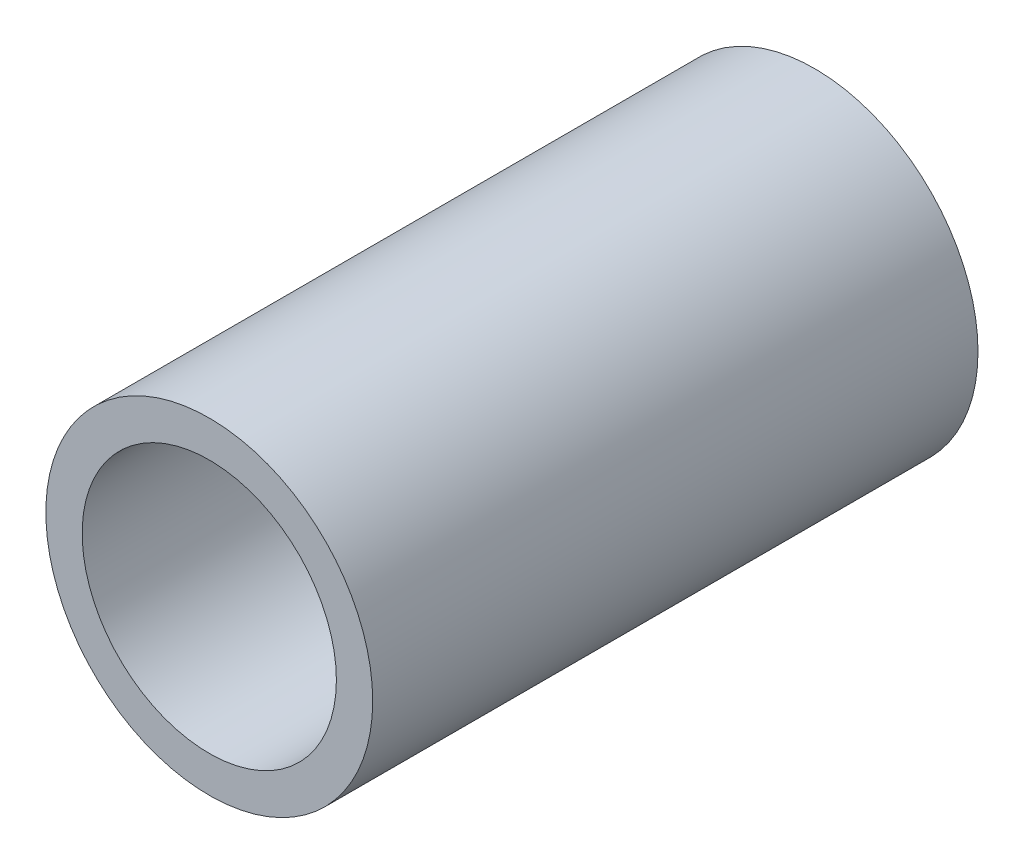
ISO-10303-21;
HEADER;
FILE_DESCRIPTION(('STEP AP214'),'2;1');
FILE_NAME('part.step','',(''),(''),'','','');
FILE_SCHEMA(('AUTOMOTIVE_DESIGN { 1 0 10303 214 1 1 1 1 }'));
ENDSEC;
DATA;
#1=APPLICATION_CONTEXT('core data for automotive mechanical design processes');
#2=APPLICATION_PROTOCOL_DEFINITION('international standard','automotive_design',2000,#1);
#3=PRODUCT_CONTEXT('',#1,'mechanical');
#4=PRODUCT('Part','Part','',(#3));
#5=PRODUCT_RELATED_PRODUCT_CATEGORY('part','',(#4));
#6=PRODUCT_DEFINITION_FORMATION('','',#4);
#7=PRODUCT_DEFINITION_CONTEXT('part definition',#1,'design');
#8=PRODUCT_DEFINITION('design','',#6,#7);
#9=PRODUCT_DEFINITION_SHAPE('','',#8);
#10=(LENGTH_UNIT() NAMED_UNIT(*) SI_UNIT(.MILLI.,.METRE.));
#11=(NAMED_UNIT(*) PLANE_ANGLE_UNIT() SI_UNIT($,.RADIAN.));
#12=(NAMED_UNIT(*) SI_UNIT($,.STERADIAN.) SOLID_ANGLE_UNIT());
#13=UNCERTAINTY_MEASURE_WITH_UNIT(LENGTH_MEASURE(1.E-05),#10,'distance_accuracy_value','');
#14=(GEOMETRIC_REPRESENTATION_CONTEXT(3) GLOBAL_UNCERTAINTY_ASSIGNED_CONTEXT((#13)) GLOBAL_UNIT_ASSIGNED_CONTEXT((#10,
#11,#12)) REPRESENTATION_CONTEXT('',''));
#15=CARTESIAN_POINT('',(0.,0.,0.));
#16=DIRECTION('',(0.,0.,1.));
#17=DIRECTION('',(1.,0.,0.));
#18=AXIS2_PLACEMENT_3D('',#15,#16,#17);
#19=CARTESIAN_POINT('',(0.,0.,50.));
#20=DIRECTION('',(0.,0.,1.));
#21=DIRECTION('',(1.,0.,0.));
#22=AXIS2_PLACEMENT_3D('',#19,#20,#21);
#23=PLANE('',#22);
#24=CARTESIAN_POINT('',(0.,0.,50.));
#25=DIRECTION('',(0.,0.,1.));
#26=DIRECTION('',(1.,0.,0.));
#27=AXIS2_PLACEMENT_3D('',#24,#25,#26);
#28=CIRCLE('',#27,13.5);
#29=CARTESIAN_POINT('',(13.5,0.,50.));
#30=VERTEX_POINT('',#29);
#31=EDGE_CURVE('E11',#30,#30,#28,.T.);
#32=ORIENTED_EDGE('',*,*,#31,.T.);
#33=EDGE_LOOP('',(#32));
#34=FACE_BOUND('',#33,.T.);
#35=CARTESIAN_POINT('',(0.,0.,50.));
#36=DIRECTION('',(0.,0.,1.));
#37=DIRECTION('',(1.,0.,0.));
#38=AXIS2_PLACEMENT_3D('',#35,#36,#37);
#39=CIRCLE('',#38,10.5);
#40=CARTESIAN_POINT('',(10.5,0.,50.));
#41=VERTEX_POINT('',#40);
#42=EDGE_CURVE('E47',#41,#41,#39,.T.);
#43=ORIENTED_EDGE('',*,*,#42,.F.);
#44=EDGE_LOOP('',(#43));
#45=FACE_BOUND('',#44,.T.);
#46=ADVANCED_FACE('F36',(#34,#45),#23,.T.);
#47=CARTESIAN_POINT('',(0.,0.,0.));
#48=DIRECTION('',(0.,0.,1.));
#49=DIRECTION('',(1.,0.,0.));
#50=AXIS2_PLACEMENT_3D('',#47,#48,#49);
#51=PLANE('',#50);
#52=CARTESIAN_POINT('',(0.,0.,0.));
#53=DIRECTION('',(0.,0.,1.));
#54=DIRECTION('',(1.,0.,0.));
#55=AXIS2_PLACEMENT_3D('',#52,#53,#54);
#56=CIRCLE('',#55,13.5);
#57=CARTESIAN_POINT('',(13.5,0.,0.));
#58=VERTEX_POINT('',#57);
#59=EDGE_CURVE('E40',#58,#58,#56,.T.);
#60=ORIENTED_EDGE('',*,*,#59,.F.);
#61=EDGE_LOOP('',(#60));
#62=FACE_BOUND('',#61,.T.);
#63=CARTESIAN_POINT('',(0.,0.,0.));
#64=DIRECTION('',(0.,0.,1.));
#65=DIRECTION('',(1.,0.,0.));
#66=AXIS2_PLACEMENT_3D('',#63,#64,#65);
#67=CIRCLE('',#66,10.5);
#68=CARTESIAN_POINT('',(10.5,0.,0.));
#69=VERTEX_POINT('',#68);
#70=EDGE_CURVE('E49',#69,#69,#67,.T.);
#71=ORIENTED_EDGE('',*,*,#70,.T.);
#72=EDGE_LOOP('',(#71));
#73=FACE_BOUND('',#72,.T.);
#74=ADVANCED_FACE('F59',(#62,#73),#51,.F.);
#75=CARTESIAN_POINT('',(0.,0.,50.));
#76=DIRECTION('',(0.,0.,-1.));
#77=DIRECTION('',(-1.,0.,0.));
#78=AXIS2_PLACEMENT_3D('',#75,#76,#77);
#79=CYLINDRICAL_SURFACE('',#78,13.5);
#80=ORIENTED_EDGE('',*,*,#31,.F.);
#81=EDGE_LOOP('',(#80));
#82=FACE_BOUND('',#81,.T.);
#83=ORIENTED_EDGE('',*,*,#59,.T.);
#84=EDGE_LOOP('',(#83));
#85=FACE_BOUND('',#84,.T.);
#86=ADVANCED_FACE('F38',(#82,#85),#79,.T.);
#87=CARTESIAN_POINT('',(0.,0.,50.));
#88=DIRECTION('',(0.,0.,-1.));
#89=DIRECTION('',(-1.,0.,0.));
#90=AXIS2_PLACEMENT_3D('',#87,#88,#89);
#91=CYLINDRICAL_SURFACE('',#90,10.5);
#92=ORIENTED_EDGE('',*,*,#42,.T.);
#93=EDGE_LOOP('',(#92));
#94=FACE_BOUND('',#93,.T.);
#95=ORIENTED_EDGE('',*,*,#70,.F.);
#96=EDGE_LOOP('',(#95));
#97=FACE_BOUND('',#96,.T.);
#98=ADVANCED_FACE('F55',(#94,#97),#91,.F.);
#99=CLOSED_SHELL('',(#46,#74,#86,#98));
#100=MANIFOLD_SOLID_BREP('B2',#99);
#101=ADVANCED_BREP_SHAPE_REPRESENTATION('',(#18,#100),#14);
#102=SHAPE_DEFINITION_REPRESENTATION(#9,#101);
ENDSEC;
END-ISO-10303-21;
